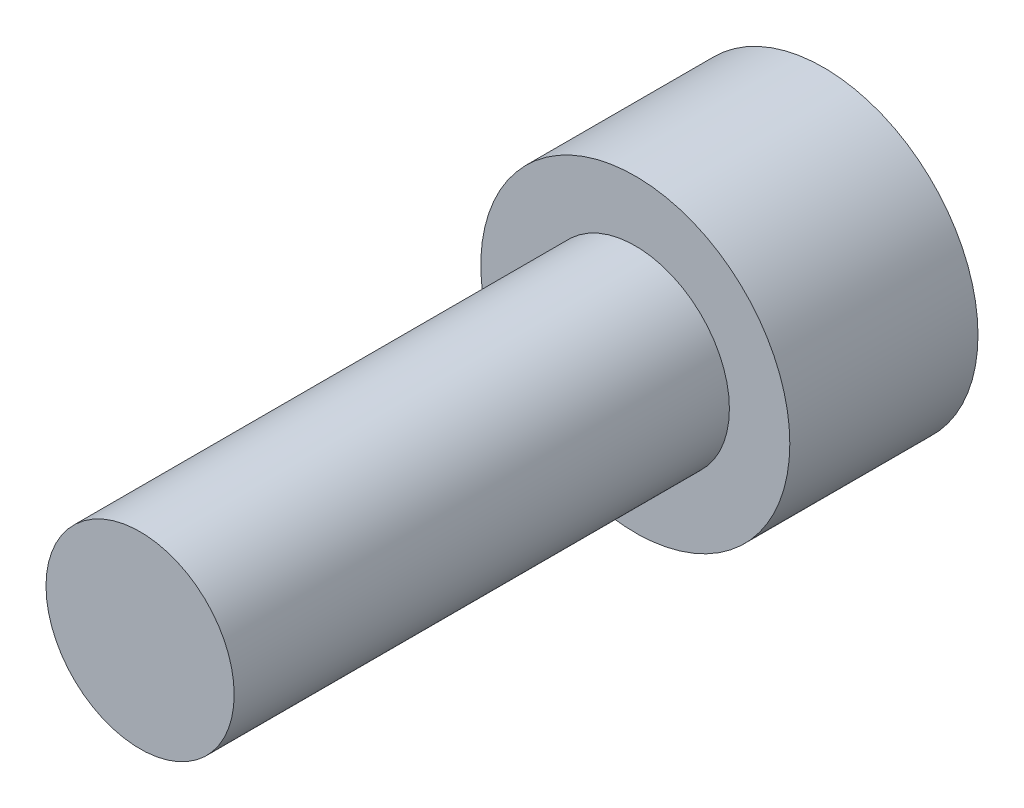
from build123d import *

# Parameters (mm, degrees)
HEX_2_DEPTH = 3.048


with BuildPart() as part:
    # Sketch6 → Revolve1 (revolve)
    with BuildSketch(Plane(origin=(0, 0, 0), x_dir=(0, 0, -1), z_dir=(1, 0, 0)), mode=Mode.PRIVATE) as revolve1_sk:
        Polygon((-12.7, 0), (-12.7, -2.413), (0, -2.413), (0, -3.9624), (4.826, -3.9624), (4.826, 0), align=None)
    revolve(revolve1_sk.sketch.rotate(Axis((0, 0, 12.7), (0, 0, -1)), 270), axis=Axis((0, 0, 12.7), (0, 0, -1)))

    # Sketch7 → HEX 2 (cut)
    with BuildSketch(Plane(origin=(0, 0, -4.826), x_dir=(-1, 0, 0), z_dir=(0, 0, -1))):
        Polygon((-1.9812, 1.143846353), (-1.9812, -1.143846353), (0, -2.287692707), (1.9812, -1.143846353), (1.9812, 1.143846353), (0, 2.287692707), align=None)
    extrude(amount=-HEX_2_DEPTH, mode=Mode.SUBTRACT)


solid = part.part
